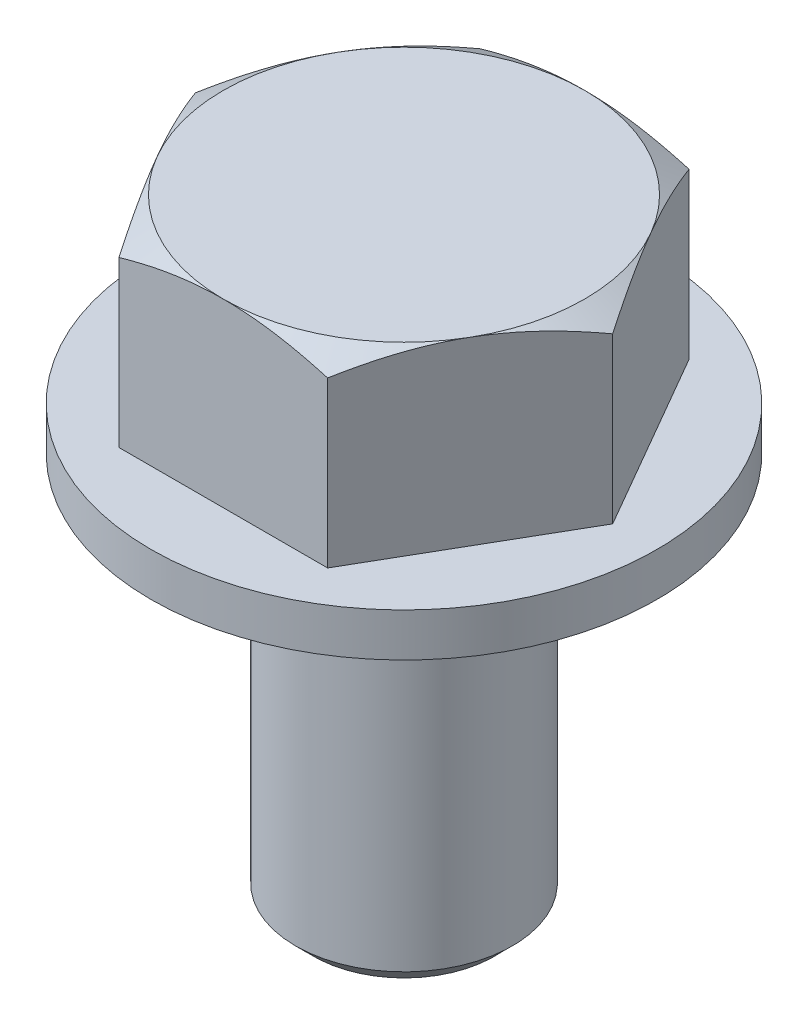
from build123d import *

# Parameters (mm, degrees)
EXTRUSION1_DEPTH = 2.5
ESQUISSE3_R      = 3
EXTRUSION2_DEPTH = 12
CHANFREIN1_SIZE  = 0.5
ESQUISSE4_W      = 3.5
ESQUISSE4_H      = 1.2


with BuildPart() as part:
    # Esquisse1 → Extrusion1 (new, symmetric)
    with BuildSketch(Plane(origin=(0, 0, 0), x_dir=(1, 0, 0), z_dir=(0, 1, 0))):
        Polygon((5.773502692, 0), (2.886751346, 5), (-2.886751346, 5), (-5.773502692, 0), (-2.886751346, -5), (2.886751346, -5), align=None)
    extrude(amount=EXTRUSION1_DEPTH, both=True)

    # Esquisse2 → Enl_vement de mati_re-R_volution4 (revolve, cut)
    with BuildSketch(Plane(origin=(0, 0, 0), x_dir=(0, 0, -1), z_dir=(1, 0, 0))):
        Polygon((2, 4.232050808), (8, 4.232050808), (8, 0.767949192), align=None)
    revolve(axis=Axis((0, 9.378046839, 0), (0, -1, 0)), mode=Mode.SUBTRACT)

    # Esquisse3 → Extrusion2 (add)
    with BuildSketch(Plane.XZ.offset(2.5)):
        with Locations(Location((0, 0, 0), (0, 0, 90))):
            Circle(ESQUISSE3_R)
    extrude(amount=EXTRUSION2_DEPTH)

    # Chanfrein1
    chanfrein1_edges = [part.edges().sort_by_distance(p)[0] for p in [
        (0, -14.5, -3),
    ]]
    chamfer(chanfrein1_edges, length=CHANFREIN1_SIZE)

    # Esquisse4 → R_volution1 (revolve)
    with BuildSketch(Plane.XY, mode=Mode.PRIVATE) as r_volution1_sk:
        with Locations((5.25, -3.1)):
            Rectangle(ESQUISSE4_W, ESQUISSE4_H)
    revolve(r_volution1_sk.sketch.rotate(Axis((0, 0, 0), (0, -1, 0)), 90), axis=Axis((0, 0, 0), (0, -1, 0)))


solid = part.part
